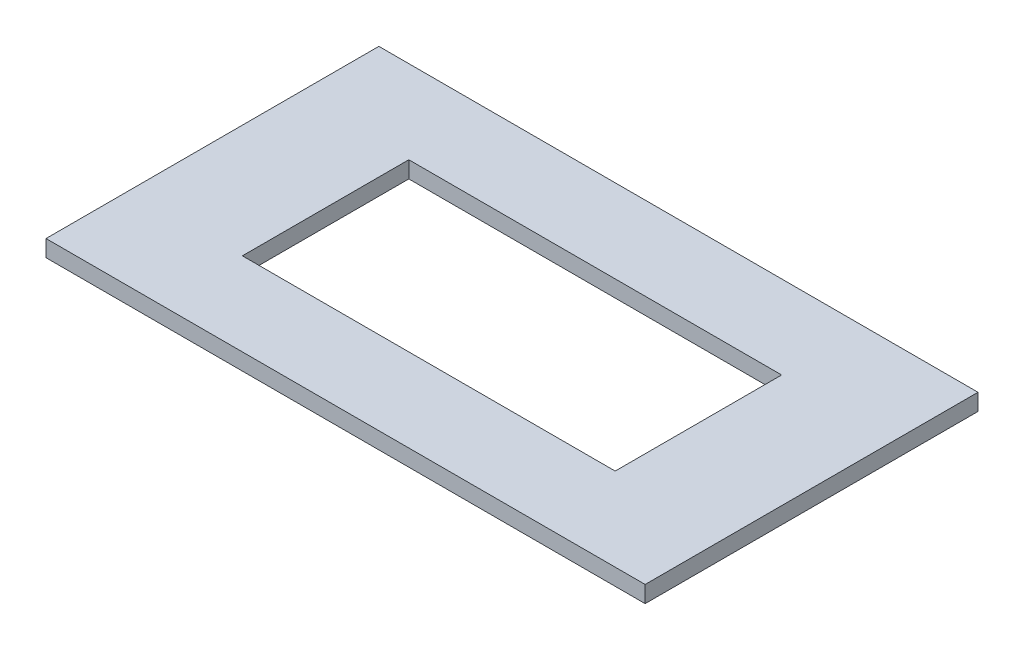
from build123d import *

# Parameters (mm, degrees)
SKETCH1_W           = 90
SKETCH1_H           = 50
SKETCH1_W_2         = 56
SKETCH1_H_2         = 25
BOSS_EXTRUDE1_DEPTH = 2.5


with BuildPart() as part:
    # Sketch1 → Boss-Extrude1 (new body)
    with BuildSketch(Plane(origin=(0, 0, 0), x_dir=(1, 0, 0), z_dir=(0, 1, 0))):
        Rectangle(SKETCH1_W, SKETCH1_H)
        Rectangle(SKETCH1_W_2, SKETCH1_H_2, mode=Mode.SUBTRACT)
    extrude(amount=BOSS_EXTRUDE1_DEPTH)


solid = part.part
